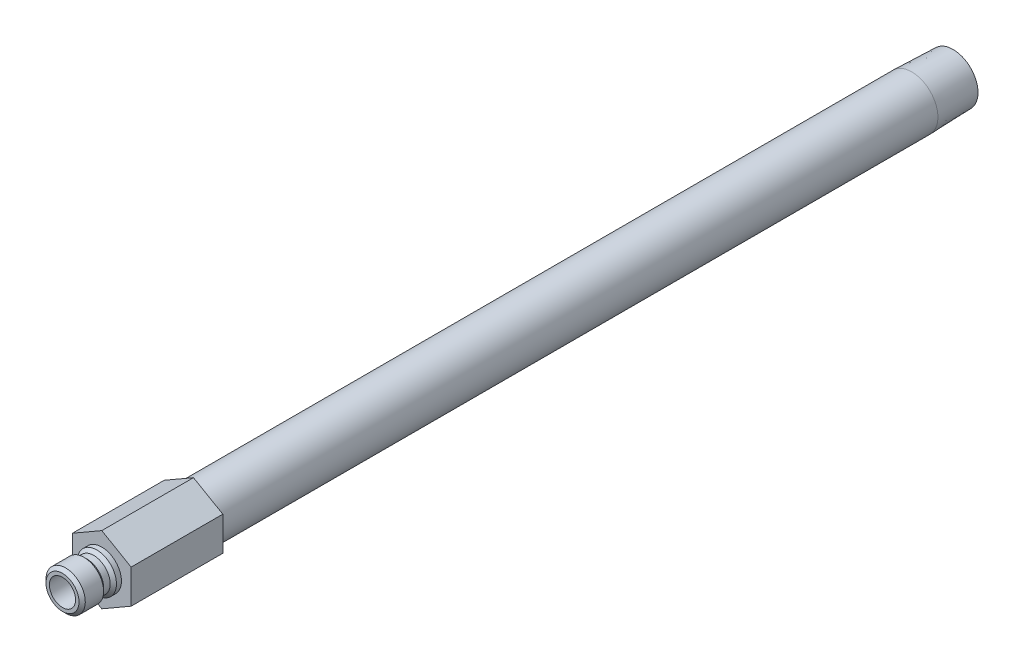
ISO-10303-21;
HEADER;
FILE_DESCRIPTION(('STEP AP214'),'2;1');
FILE_NAME('part.step','',(''),(''),'','','');
FILE_SCHEMA(('AUTOMOTIVE_DESIGN { 1 0 10303 214 1 1 1 1 }'));
ENDSEC;
DATA;
#1=APPLICATION_CONTEXT('core data for automotive mechanical design processes');
#2=APPLICATION_PROTOCOL_DEFINITION('international standard','automotive_design',2000,#1);
#3=PRODUCT_CONTEXT('',#1,'mechanical');
#4=PRODUCT('Part','Part','',(#3));
#5=PRODUCT_RELATED_PRODUCT_CATEGORY('part','',(#4));
#6=PRODUCT_DEFINITION_FORMATION('','',#4);
#7=PRODUCT_DEFINITION_CONTEXT('part definition',#1,'design');
#8=PRODUCT_DEFINITION('design','',#6,#7);
#9=PRODUCT_DEFINITION_SHAPE('','',#8);
#10=(LENGTH_UNIT() NAMED_UNIT(*) SI_UNIT(.MILLI.,.METRE.));
#11=(NAMED_UNIT(*) PLANE_ANGLE_UNIT() SI_UNIT($,.RADIAN.));
#12=(NAMED_UNIT(*) SI_UNIT($,.STERADIAN.) SOLID_ANGLE_UNIT());
#13=UNCERTAINTY_MEASURE_WITH_UNIT(LENGTH_MEASURE(1.E-05),#10,'distance_accuracy_value','');
#14=(GEOMETRIC_REPRESENTATION_CONTEXT(3) GLOBAL_UNCERTAINTY_ASSIGNED_CONTEXT((#13)) GLOBAL_UNIT_ASSIGNED_CONTEXT((#10,
#11,#12)) REPRESENTATION_CONTEXT('',''));
#15=CARTESIAN_POINT('',(0.,0.,0.));
#16=DIRECTION('',(0.,0.,1.));
#17=DIRECTION('',(1.,0.,0.));
#18=AXIS2_PLACEMENT_3D('',#15,#16,#17);
#19=CARTESIAN_POINT('',(0.,0.,0.));
#20=DIRECTION('',(0.,0.,-1.));
#21=DIRECTION('',(0.,1.,0.));
#22=AXIS2_PLACEMENT_3D('',#19,#20,#21);
#23=CYLINDRICAL_SURFACE('',#22,6.34999999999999);
#24=CARTESIAN_POINT('',(0.,0.,-196.342));
#25=DIRECTION('',(0.,0.,-1.));
#26=DIRECTION('',(0.,1.,0.));
#27=AXIS2_PLACEMENT_3D('',#24,#25,#26);
#28=CIRCLE('',#27,6.34999999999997);
#29=CARTESIAN_POINT('',(0.,6.35,-196.342));
#30=VERTEX_POINT('',#29);
#31=EDGE_CURVE('E42',#30,#30,#28,.T.);
#32=ORIENTED_EDGE('',*,*,#31,.F.);
#33=EDGE_LOOP('',(#32));
#34=FACE_BOUND('',#33,.T.);
#35=CARTESIAN_POINT('',(0.,0.,-22.225));
#36=DIRECTION('',(0.,0.,1.));
#37=DIRECTION('',(1.,0.,0.));
#38=AXIS2_PLACEMENT_3D('',#35,#36,#37);
#39=CIRCLE('',#38,6.34999999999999);
#40=CARTESIAN_POINT('',(6.34999999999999,0.,-22.225));
#41=VERTEX_POINT('',#40);
#42=EDGE_CURVE('E138',#41,#41,#39,.F.);
#43=ORIENTED_EDGE('',*,*,#42,.T.);
#44=EDGE_LOOP('',(#43));
#45=FACE_BOUND('',#44,.T.);
#46=ADVANCED_FACE('F33',(#34,#45),#23,.T.);
#47=CARTESIAN_POINT('',(0.,6.03647060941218,-206.375));
#48=DIRECTION('',(0.,0.,-1.));
#49=DIRECTION('',(0.,1.,0.));
#50=AXIS2_PLACEMENT_3D('',#47,#48,#49);
#51=PLANE('',#50);
#52=CARTESIAN_POINT('',(0.,0.,-206.375));
#53=DIRECTION('',(0.,0.,-1.));
#54=DIRECTION('',(0.,1.,0.));
#55=AXIS2_PLACEMENT_3D('',#52,#53,#54);
#56=CIRCLE('',#55,6.03647060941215);
#57=CARTESIAN_POINT('',(0.,6.03647060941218,-206.375));
#58=VERTEX_POINT('',#57);
#59=EDGE_CURVE('E11',#58,#58,#56,.T.);
#60=ORIENTED_EDGE('',*,*,#59,.T.);
#61=EDGE_LOOP('',(#60));
#62=FACE_BOUND('',#61,.T.);
#63=CARTESIAN_POINT('',(0.,0.,-206.375));
#64=DIRECTION('',(0.,0.,-1.));
#65=DIRECTION('',(0.,1.,0.));
#66=AXIS2_PLACEMENT_3D('',#63,#64,#65);
#67=CIRCLE('',#66,4.62279999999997);
#68=CARTESIAN_POINT('',(0.,4.6228,-206.375));
#69=VERTEX_POINT('',#68);
#70=EDGE_CURVE('E146',#69,#69,#67,.T.);
#71=ORIENTED_EDGE('',*,*,#70,.F.);
#72=EDGE_LOOP('',(#71));
#73=FACE_BOUND('',#72,.T.);
#74=ADVANCED_FACE('F35',(#62,#73),#51,.T.);
#75=CARTESIAN_POINT('',(0.,0.,-206.375));
#76=DIRECTION('',(0.,0.,1.));
#77=DIRECTION('',(0.,-1.,0.));
#78=AXIS2_PLACEMENT_3D('',#75,#76,#77);
#79=CONICAL_SURFACE('',#78,6.03647060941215,0.0312396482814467);
#80=ORIENTED_EDGE('',*,*,#31,.T.);
#81=EDGE_LOOP('',(#80));
#82=FACE_BOUND('',#81,.T.);
#83=ORIENTED_EDGE('',*,*,#59,.F.);
#84=EDGE_LOOP('',(#83));
#85=FACE_BOUND('',#84,.T.);
#86=ADVANCED_FACE('F181',(#82,#85),#79,.T.);
#87=CARTESIAN_POINT('',(0.,4.7625,0.));
#88=DIRECTION('',(0.,0.,1.));
#89=DIRECTION('',(0.,-1.,0.));
#90=AXIS2_PLACEMENT_3D('',#87,#88,#89);
#91=PLANE('',#90);
#92=CARTESIAN_POINT('',(0.,0.,0.));
#93=DIRECTION('',(0.,0.,-1.));
#94=DIRECTION('',(0.,1.,0.));
#95=AXIS2_PLACEMENT_3D('',#92,#93,#94);
#96=CIRCLE('',#95,4.7625);
#97=CARTESIAN_POINT('',(0.,4.7625,0.));
#98=VERTEX_POINT('',#97);
#99=EDGE_CURVE('E176',#98,#98,#96,.T.);
#100=ORIENTED_EDGE('',*,*,#99,.T.);
#101=EDGE_LOOP('',(#100));
#102=FACE_BOUND('',#101,.T.);
#103=DIRECTION('',(-0.866025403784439,-0.5,0.));
#104=VECTOR('',#103,1.);
#105=CARTESIAN_POINT('',(0.,8.21223022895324,0.));
#106=LINE('',#105,#104);
#107=CARTESIAN_POINT('',(0.,8.21223022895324,0.));
#108=VERTEX_POINT('',#107);
#109=CARTESIAN_POINT('',(-7.112,4.10611511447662,0.));
#110=VERTEX_POINT('',#109);
#111=EDGE_CURVE('E121',#108,#110,#106,.T.);
#112=ORIENTED_EDGE('',*,*,#111,.T.);
#113=DIRECTION('',(0.,-1.,0.));
#114=VECTOR('',#113,1.);
#115=CARTESIAN_POINT('',(-7.112,4.10611511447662,0.));
#116=LINE('',#115,#114);
#117=CARTESIAN_POINT('',(-7.112,-4.10611511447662,0.));
#118=VERTEX_POINT('',#117);
#119=EDGE_CURVE('E124',#110,#118,#116,.T.);
#120=ORIENTED_EDGE('',*,*,#119,.T.);
#121=DIRECTION('',(0.866025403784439,-0.5,0.));
#122=VECTOR('',#121,1.);
#123=CARTESIAN_POINT('',(-7.112,-4.10611511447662,0.));
#124=LINE('',#123,#122);
#125=CARTESIAN_POINT('',(0.,-8.21223022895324,0.));
#126=VERTEX_POINT('',#125);
#127=EDGE_CURVE('E127',#118,#126,#124,.T.);
#128=ORIENTED_EDGE('',*,*,#127,.T.);
#129=DIRECTION('',(0.866025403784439,0.5,0.));
#130=VECTOR('',#129,1.);
#131=CARTESIAN_POINT('',(0.,-8.21223022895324,0.));
#132=LINE('',#131,#130);
#133=CARTESIAN_POINT('',(7.112,-4.10611511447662,0.));
#134=VERTEX_POINT('',#133);
#135=EDGE_CURVE('E130',#126,#134,#132,.T.);
#136=ORIENTED_EDGE('',*,*,#135,.T.);
#137=DIRECTION('',(0.,1.,0.));
#138=VECTOR('',#137,1.);
#139=CARTESIAN_POINT('',(7.112,-4.10611511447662,0.));
#140=LINE('',#139,#138);
#141=CARTESIAN_POINT('',(7.112,4.10611511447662,0.));
#142=VERTEX_POINT('',#141);
#143=EDGE_CURVE('E98',#134,#142,#140,.T.);
#144=ORIENTED_EDGE('',*,*,#143,.T.);
#145=DIRECTION('',(-0.866025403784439,0.5,0.));
#146=VECTOR('',#145,1.);
#147=CARTESIAN_POINT('',(7.112,4.10611511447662,0.));
#148=LINE('',#147,#146);
#149=EDGE_CURVE('E133',#142,#108,#148,.T.);
#150=ORIENTED_EDGE('',*,*,#149,.T.);
#151=EDGE_LOOP('',(#112,#120,#128,#136,#144,#150));
#152=FACE_BOUND('',#151,.T.);
#153=ADVANCED_FACE('F250',(#102,#152),#91,.T.);
#154=CARTESIAN_POINT('',(0.,0.,0.));
#155=DIRECTION('',(0.,0.,-1.));
#156=DIRECTION('',(0.,1.,0.));
#157=AXIS2_PLACEMENT_3D('',#154,#155,#156);
#158=CYLINDRICAL_SURFACE('',#157,4.7625);
#159=CARTESIAN_POINT('',(0.,0.,1.2065));
#160=DIRECTION('',(0.,0.,-1.));
#161=DIRECTION('',(0.,1.,0.));
#162=AXIS2_PLACEMENT_3D('',#159,#160,#161);
#163=CIRCLE('',#162,4.7625);
#164=CARTESIAN_POINT('',(0.,4.7625,1.2065));
#165=VERTEX_POINT('',#164);
#166=EDGE_CURVE('E173',#165,#165,#163,.T.);
#167=ORIENTED_EDGE('',*,*,#166,.T.);
#168=EDGE_LOOP('',(#167));
#169=FACE_BOUND('',#168,.T.);
#170=ORIENTED_EDGE('',*,*,#99,.F.);
#171=EDGE_LOOP('',(#170));
#172=FACE_BOUND('',#171,.T.);
#173=ADVANCED_FACE('F246',(#169,#172),#158,.T.);
#174=CARTESIAN_POINT('',(0.,0.,1.2065));
#175=DIRECTION('',(0.,0.,-1.));
#176=DIRECTION('',(0.,1.,0.));
#177=AXIS2_PLACEMENT_3D('',#174,#175,#176);
#178=CONICAL_SURFACE('',#177,4.7625,0.785398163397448);
#179=CARTESIAN_POINT('',(0.,0.,1.9685));
#180=DIRECTION('',(0.,0.,-1.));
#181=DIRECTION('',(0.,1.,0.));
#182=AXIS2_PLACEMENT_3D('',#179,#180,#181);
#183=CIRCLE('',#182,4.0005);
#184=CARTESIAN_POINT('',(0.,4.0005,1.9685));
#185=VERTEX_POINT('',#184);
#186=EDGE_CURVE('E170',#185,#185,#183,.T.);
#187=ORIENTED_EDGE('',*,*,#186,.T.);
#188=EDGE_LOOP('',(#187));
#189=FACE_BOUND('',#188,.T.);
#190=ORIENTED_EDGE('',*,*,#166,.F.);
#191=EDGE_LOOP('',(#190));
#192=FACE_BOUND('',#191,.T.);
#193=ADVANCED_FACE('F242',(#189,#192),#178,.T.);
#194=CARTESIAN_POINT('',(0.,0.,0.));
#195=DIRECTION('',(0.,0.,-1.));
#196=DIRECTION('',(0.,1.,0.));
#197=AXIS2_PLACEMENT_3D('',#194,#195,#196);
#198=CYLINDRICAL_SURFACE('',#197,4.0005);
#199=CARTESIAN_POINT('',(0.,0.,3.556));
#200=DIRECTION('',(0.,0.,-1.));
#201=DIRECTION('',(0.,1.,0.));
#202=AXIS2_PLACEMENT_3D('',#199,#200,#201);
#203=CIRCLE('',#202,4.0005);
#204=CARTESIAN_POINT('',(0.,4.0005,3.556));
#205=VERTEX_POINT('',#204);
#206=EDGE_CURVE('E167',#205,#205,#203,.T.);
#207=ORIENTED_EDGE('',*,*,#206,.T.);
#208=EDGE_LOOP('',(#207));
#209=FACE_BOUND('',#208,.T.);
#210=ORIENTED_EDGE('',*,*,#186,.F.);
#211=EDGE_LOOP('',(#210));
#212=FACE_BOUND('',#211,.T.);
#213=ADVANCED_FACE('F238',(#209,#212),#198,.T.);
#214=CARTESIAN_POINT('',(0.,0.,3.556));
#215=DIRECTION('',(0.,0.,1.));
#216=DIRECTION('',(0.,-1.,0.));
#217=AXIS2_PLACEMENT_3D('',#214,#215,#216);
#218=CONICAL_SURFACE('',#217,4.0005,0.785398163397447);
#219=CARTESIAN_POINT('',(0.,0.,4.318));
#220=DIRECTION('',(0.,0.,-1.));
#221=DIRECTION('',(0.,1.,0.));
#222=AXIS2_PLACEMENT_3D('',#219,#220,#221);
#223=CIRCLE('',#222,4.7625);
#224=CARTESIAN_POINT('',(0.,4.7625,4.318));
#225=VERTEX_POINT('',#224);
#226=EDGE_CURVE('E164',#225,#225,#223,.T.);
#227=ORIENTED_EDGE('',*,*,#226,.T.);
#228=EDGE_LOOP('',(#227));
#229=FACE_BOUND('',#228,.T.);
#230=ORIENTED_EDGE('',*,*,#206,.F.);
#231=EDGE_LOOP('',(#230));
#232=FACE_BOUND('',#231,.T.);
#233=ADVANCED_FACE('F234',(#229,#232),#218,.T.);
#234=CARTESIAN_POINT('',(0.,0.,0.));
#235=DIRECTION('',(0.,0.,-1.));
#236=DIRECTION('',(0.,1.,0.));
#237=AXIS2_PLACEMENT_3D('',#234,#235,#236);
#238=CYLINDRICAL_SURFACE('',#237,4.7625);
#239=CARTESIAN_POINT('',(0.,0.,8.763));
#240=DIRECTION('',(0.,0.,-1.));
#241=DIRECTION('',(0.,1.,0.));
#242=AXIS2_PLACEMENT_3D('',#239,#240,#241);
#243=CIRCLE('',#242,4.7625);
#244=CARTESIAN_POINT('',(0.,4.7625,8.763));
#245=VERTEX_POINT('',#244);
#246=EDGE_CURVE('E161',#245,#245,#243,.T.);
#247=ORIENTED_EDGE('',*,*,#246,.T.);
#248=EDGE_LOOP('',(#247));
#249=FACE_BOUND('',#248,.T.);
#250=ORIENTED_EDGE('',*,*,#226,.F.);
#251=EDGE_LOOP('',(#250));
#252=FACE_BOUND('',#251,.T.);
#253=ADVANCED_FACE('F230',(#249,#252),#238,.T.);
#254=CARTESIAN_POINT('',(0.,0.,8.763));
#255=DIRECTION('',(0.,0.,-1.));
#256=DIRECTION('',(0.,1.,0.));
#257=AXIS2_PLACEMENT_3D('',#254,#255,#256);
#258=CONICAL_SURFACE('',#257,4.7625,0.785398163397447);
#259=CARTESIAN_POINT('',(0.,0.,9.525));
#260=DIRECTION('',(0.,0.,-1.));
#261=DIRECTION('',(0.,1.,0.));
#262=AXIS2_PLACEMENT_3D('',#259,#260,#261);
#263=CIRCLE('',#262,4.0005);
#264=CARTESIAN_POINT('',(0.,4.0005,9.525));
#265=VERTEX_POINT('',#264);
#266=EDGE_CURVE('E158',#265,#265,#263,.T.);
#267=ORIENTED_EDGE('',*,*,#266,.T.);
#268=EDGE_LOOP('',(#267));
#269=FACE_BOUND('',#268,.T.);
#270=ORIENTED_EDGE('',*,*,#246,.F.);
#271=EDGE_LOOP('',(#270));
#272=FACE_BOUND('',#271,.T.);
#273=ADVANCED_FACE('F226',(#269,#272),#258,.T.);
#274=CARTESIAN_POINT('',(0.,3.175,9.525));
#275=DIRECTION('',(0.,0.,1.));
#276=DIRECTION('',(0.,-1.,0.));
#277=AXIS2_PLACEMENT_3D('',#274,#275,#276);
#278=PLANE('',#277);
#279=CARTESIAN_POINT('',(0.,0.,9.525));
#280=DIRECTION('',(0.,0.,-1.));
#281=DIRECTION('',(0.,1.,0.));
#282=AXIS2_PLACEMENT_3D('',#279,#280,#281);
#283=CIRCLE('',#282,3.175);
#284=CARTESIAN_POINT('',(0.,3.175,9.525));
#285=VERTEX_POINT('',#284);
#286=EDGE_CURVE('E155',#285,#285,#283,.T.);
#287=ORIENTED_EDGE('',*,*,#286,.T.);
#288=EDGE_LOOP('',(#287));
#289=FACE_BOUND('',#288,.T.);
#290=ORIENTED_EDGE('',*,*,#266,.F.);
#291=EDGE_LOOP('',(#290));
#292=FACE_BOUND('',#291,.T.);
#293=ADVANCED_FACE('F222',(#289,#292),#278,.T.);
#294=CARTESIAN_POINT('',(0.,0.,0.));
#295=DIRECTION('',(0.,0.,-1.));
#296=DIRECTION('',(0.,1.,0.));
#297=AXIS2_PLACEMENT_3D('',#294,#295,#296);
#298=CYLINDRICAL_SURFACE('',#297,3.175);
#299=ORIENTED_EDGE('',*,*,#286,.F.);
#300=EDGE_LOOP('',(#299));
#301=FACE_BOUND('',#300,.T.);
#302=CARTESIAN_POINT('',(0.,0.,-22.225));
#303=DIRECTION('',(0.,0.,-1.));
#304=DIRECTION('',(0.,1.,0.));
#305=AXIS2_PLACEMENT_3D('',#302,#303,#304);
#306=CIRCLE('',#305,3.175);
#307=CARTESIAN_POINT('',(0.,3.175,-22.225));
#308=VERTEX_POINT('',#307);
#309=EDGE_CURVE('E152',#308,#308,#306,.T.);
#310=ORIENTED_EDGE('',*,*,#309,.T.);
#311=EDGE_LOOP('',(#310));
#312=FACE_BOUND('',#311,.T.);
#313=ADVANCED_FACE('F218',(#301,#312),#298,.F.);
#314=CARTESIAN_POINT('',(0.,4.6228,-22.225));
#315=DIRECTION('',(0.,0.,-1.));
#316=DIRECTION('',(0.,1.,0.));
#317=AXIS2_PLACEMENT_3D('',#314,#315,#316);
#318=PLANE('',#317);
#319=CARTESIAN_POINT('',(0.,0.,-22.225));
#320=DIRECTION('',(0.,0.,-1.));
#321=DIRECTION('',(0.,1.,0.));
#322=AXIS2_PLACEMENT_3D('',#319,#320,#321);
#323=CIRCLE('',#322,4.6228);
#324=CARTESIAN_POINT('',(0.,4.6228,-22.225));
#325=VERTEX_POINT('',#324);
#326=EDGE_CURVE('E149',#325,#325,#323,.T.);
#327=ORIENTED_EDGE('',*,*,#326,.T.);
#328=EDGE_LOOP('',(#327));
#329=FACE_BOUND('',#328,.T.);
#330=ORIENTED_EDGE('',*,*,#309,.F.);
#331=EDGE_LOOP('',(#330));
#332=FACE_BOUND('',#331,.T.);
#333=ADVANCED_FACE('F199',(#329,#332),#318,.T.);
#334=CARTESIAN_POINT('',(0.,0.,0.));
#335=DIRECTION('',(0.,0.,-1.));
#336=DIRECTION('',(0.,1.,0.));
#337=AXIS2_PLACEMENT_3D('',#334,#335,#336);
#338=CYLINDRICAL_SURFACE('',#337,4.62279999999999);
#339=ORIENTED_EDGE('',*,*,#70,.T.);
#340=EDGE_LOOP('',(#339));
#341=FACE_BOUND('',#340,.T.);
#342=ORIENTED_EDGE('',*,*,#326,.F.);
#343=EDGE_LOOP('',(#342));
#344=FACE_BOUND('',#343,.T.);
#345=ADVANCED_FACE('F191',(#341,#344),#338,.F.);
#346=CARTESIAN_POINT('',(-7.112,4.10611511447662,-22.225));
#347=DIRECTION('',(0.,0.,1.));
#348=DIRECTION('',(1.,0.,0.));
#349=AXIS2_PLACEMENT_3D('',#346,#347,#348);
#350=PLANE('',#349);
#351=ORIENTED_EDGE('',*,*,#42,.F.);
#352=EDGE_LOOP('',(#351));
#353=FACE_BOUND('',#352,.T.);
#354=DIRECTION('',(-0.866025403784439,-0.5,0.));
#355=VECTOR('',#354,1.);
#356=CARTESIAN_POINT('',(0.,8.21223022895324,-22.225));
#357=LINE('',#356,#355);
#358=CARTESIAN_POINT('',(0.,8.21223022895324,-22.225));
#359=VERTEX_POINT('',#358);
#360=CARTESIAN_POINT('',(-7.112,4.10611511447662,-22.225));
#361=VERTEX_POINT('',#360);
#362=EDGE_CURVE('E136',#359,#361,#357,.T.);
#363=ORIENTED_EDGE('',*,*,#362,.F.);
#364=DIRECTION('',(-0.866025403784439,0.5,0.));
#365=VECTOR('',#364,1.);
#366=CARTESIAN_POINT('',(7.112,4.10611511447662,-22.225));
#367=LINE('',#366,#365);
#368=CARTESIAN_POINT('',(7.112,4.10611511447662,-22.225));
#369=VERTEX_POINT('',#368);
#370=EDGE_CURVE('E111',#369,#359,#367,.T.);
#371=ORIENTED_EDGE('',*,*,#370,.F.);
#372=DIRECTION('',(0.,1.,0.));
#373=VECTOR('',#372,1.);
#374=CARTESIAN_POINT('',(7.112,-4.10611511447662,-22.225));
#375=LINE('',#374,#373);
#376=CARTESIAN_POINT('',(7.112,-4.10611511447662,-22.225));
#377=VERTEX_POINT('',#376);
#378=EDGE_CURVE('E96',#377,#369,#375,.T.);
#379=ORIENTED_EDGE('',*,*,#378,.F.);
#380=DIRECTION('',(0.866025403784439,0.5,0.));
#381=VECTOR('',#380,1.);
#382=CARTESIAN_POINT('',(0.,-8.21223022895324,-22.225));
#383=LINE('',#382,#381);
#384=CARTESIAN_POINT('',(0.,-8.21223022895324,-22.225));
#385=VERTEX_POINT('',#384);
#386=EDGE_CURVE('E109',#385,#377,#383,.T.);
#387=ORIENTED_EDGE('',*,*,#386,.F.);
#388=DIRECTION('',(0.866025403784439,-0.5,0.));
#389=VECTOR('',#388,1.);
#390=CARTESIAN_POINT('',(-7.112,-4.10611511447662,-22.225));
#391=LINE('',#390,#389);
#392=CARTESIAN_POINT('',(-7.112,-4.10611511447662,-22.225));
#393=VERTEX_POINT('',#392);
#394=EDGE_CURVE('E114',#393,#385,#391,.T.);
#395=ORIENTED_EDGE('',*,*,#394,.F.);
#396=DIRECTION('',(0.,-1.,0.));
#397=VECTOR('',#396,1.);
#398=CARTESIAN_POINT('',(-7.112,4.10611511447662,-22.225));
#399=LINE('',#398,#397);
#400=EDGE_CURVE('E116',#361,#393,#399,.T.);
#401=ORIENTED_EDGE('',*,*,#400,.F.);
#402=EDGE_LOOP('',(#363,#371,#379,#387,#395,#401));
#403=FACE_BOUND('',#402,.T.);
#404=ADVANCED_FACE('F107',(#353,#403),#350,.F.);
#405=CARTESIAN_POINT('',(0.,8.21223022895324,-22.225));
#406=DIRECTION('',(-0.5,0.866025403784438,0.));
#407=DIRECTION('',(-0.866025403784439,-0.5,0.));
#408=AXIS2_PLACEMENT_3D('',#405,#406,#407);
#409=PLANE('',#408);
#410=ORIENTED_EDGE('',*,*,#111,.F.);
#411=DIRECTION('',(0.,0.,1.));
#412=VECTOR('',#411,1.);
#413=CARTESIAN_POINT('',(0.,8.21223022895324,-22.225));
#414=LINE('',#413,#412);
#415=EDGE_CURVE('E50',#359,#108,#414,.T.);
#416=ORIENTED_EDGE('',*,*,#415,.F.);
#417=ORIENTED_EDGE('',*,*,#362,.T.);
#418=DIRECTION('',(0.,0.,1.));
#419=VECTOR('',#418,1.);
#420=CARTESIAN_POINT('',(-7.112,4.10611511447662,-22.225));
#421=LINE('',#420,#419);
#422=EDGE_CURVE('E85',#361,#110,#421,.T.);
#423=ORIENTED_EDGE('',*,*,#422,.T.);
#424=EDGE_LOOP('',(#410,#416,#417,#423));
#425=FACE_BOUND('',#424,.T.);
#426=ADVANCED_FACE('F190',(#425),#409,.T.);
#427=CARTESIAN_POINT('',(7.112,4.10611511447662,-22.225));
#428=DIRECTION('',(0.5,0.866025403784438,0.));
#429=DIRECTION('',(-0.866025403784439,0.5,0.));
#430=AXIS2_PLACEMENT_3D('',#427,#428,#429);
#431=PLANE('',#430);
#432=ORIENTED_EDGE('',*,*,#149,.F.);
#433=DIRECTION('',(0.,0.,1.));
#434=VECTOR('',#433,1.);
#435=CARTESIAN_POINT('',(7.112,4.10611511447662,-22.225));
#436=LINE('',#435,#434);
#437=EDGE_CURVE('E73',#369,#142,#436,.T.);
#438=ORIENTED_EDGE('',*,*,#437,.F.);
#439=ORIENTED_EDGE('',*,*,#370,.T.);
#440=ORIENTED_EDGE('',*,*,#415,.T.);
#441=EDGE_LOOP('',(#432,#438,#439,#440));
#442=FACE_BOUND('',#441,.T.);
#443=ADVANCED_FACE('F197',(#442),#431,.T.);
#444=CARTESIAN_POINT('',(7.112,-4.10611511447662,-22.225));
#445=DIRECTION('',(1.,0.,0.));
#446=DIRECTION('',(0.,1.,0.));
#447=AXIS2_PLACEMENT_3D('',#444,#445,#446);
#448=PLANE('',#447);
#449=ORIENTED_EDGE('',*,*,#143,.F.);
#450=DIRECTION('',(0.,0.,1.));
#451=VECTOR('',#450,1.);
#452=CARTESIAN_POINT('',(7.112,-4.10611511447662,-22.225));
#453=LINE('',#452,#451);
#454=EDGE_CURVE('E93',#377,#134,#453,.T.);
#455=ORIENTED_EDGE('',*,*,#454,.F.);
#456=ORIENTED_EDGE('',*,*,#378,.T.);
#457=ORIENTED_EDGE('',*,*,#437,.T.);
#458=EDGE_LOOP('',(#449,#455,#456,#457));
#459=FACE_BOUND('',#458,.T.);
#460=ADVANCED_FACE('F95',(#459),#448,.T.);
#461=CARTESIAN_POINT('',(0.,-8.21223022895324,-22.225));
#462=DIRECTION('',(0.5,-0.866025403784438,0.));
#463=DIRECTION('',(0.866025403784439,0.5,0.));
#464=AXIS2_PLACEMENT_3D('',#461,#462,#463);
#465=PLANE('',#464);
#466=ORIENTED_EDGE('',*,*,#135,.F.);
#467=DIRECTION('',(0.,0.,1.));
#468=VECTOR('',#467,1.);
#469=CARTESIAN_POINT('',(0.,-8.21223022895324,-22.225));
#470=LINE('',#469,#468);
#471=EDGE_CURVE('E103',#385,#126,#470,.T.);
#472=ORIENTED_EDGE('',*,*,#471,.F.);
#473=ORIENTED_EDGE('',*,*,#386,.T.);
#474=ORIENTED_EDGE('',*,*,#454,.T.);
#475=EDGE_LOOP('',(#466,#472,#473,#474));
#476=FACE_BOUND('',#475,.T.);
#477=ADVANCED_FACE('F113',(#476),#465,.T.);
#478=CARTESIAN_POINT('',(-7.112,-4.10611511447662,-22.225));
#479=DIRECTION('',(-0.5,-0.866025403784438,0.));
#480=DIRECTION('',(0.866025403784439,-0.5,0.));
#481=AXIS2_PLACEMENT_3D('',#478,#479,#480);
#482=PLANE('',#481);
#483=ORIENTED_EDGE('',*,*,#127,.F.);
#484=DIRECTION('',(0.,0.,1.));
#485=VECTOR('',#484,1.);
#486=CARTESIAN_POINT('',(-7.112,-4.10611511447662,-22.225));
#487=LINE('',#486,#485);
#488=EDGE_CURVE('E141',#393,#118,#487,.T.);
#489=ORIENTED_EDGE('',*,*,#488,.F.);
#490=ORIENTED_EDGE('',*,*,#394,.T.);
#491=ORIENTED_EDGE('',*,*,#471,.T.);
#492=EDGE_LOOP('',(#483,#489,#490,#491));
#493=FACE_BOUND('',#492,.T.);
#494=ADVANCED_FACE('F209',(#493),#482,.T.);
#495=CARTESIAN_POINT('',(-7.112,4.10611511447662,-22.225));
#496=DIRECTION('',(-1.,0.,0.));
#497=DIRECTION('',(0.,0.,1.));
#498=AXIS2_PLACEMENT_3D('',#495,#496,#497);
#499=PLANE('',#498);
#500=ORIENTED_EDGE('',*,*,#119,.F.);
#501=ORIENTED_EDGE('',*,*,#422,.F.);
#502=ORIENTED_EDGE('',*,*,#400,.T.);
#503=ORIENTED_EDGE('',*,*,#488,.T.);
#504=EDGE_LOOP('',(#500,#501,#502,#503));
#505=FACE_BOUND('',#504,.T.);
#506=ADVANCED_FACE('F212',(#505),#499,.T.);
#507=CLOSED_SHELL('',(#46,#74,#86,#153,#173,#193,#213,#233,#253,#273,#293,#313,#333,#345,#404,
#426,#443,#460,#477,#494,#506));
#508=MANIFOLD_SOLID_BREP('B2',#507);
#509=ADVANCED_BREP_SHAPE_REPRESENTATION('',(#18,#508),#14);
#510=SHAPE_DEFINITION_REPRESENTATION(#9,#509);
ENDSEC;
END-ISO-10303-21;
